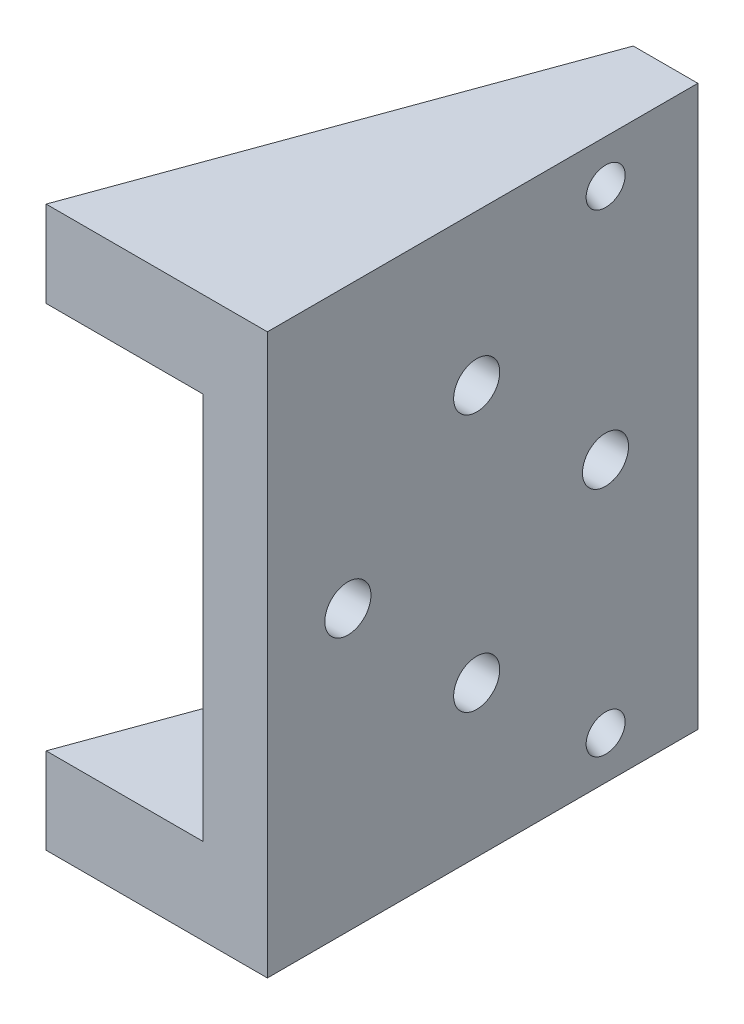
ISO-10303-21;
HEADER;
FILE_DESCRIPTION(('STEP AP214'),'2;1');
FILE_NAME('part.step','',(''),(''),'','','');
FILE_SCHEMA(('AUTOMOTIVE_DESIGN { 1 0 10303 214 1 1 1 1 }'));
ENDSEC;
DATA;
#1=APPLICATION_CONTEXT('core data for automotive mechanical design processes');
#2=APPLICATION_PROTOCOL_DEFINITION('international standard','automotive_design',2000,#1);
#3=PRODUCT_CONTEXT('',#1,'mechanical');
#4=PRODUCT('Part','Part','',(#3));
#5=PRODUCT_RELATED_PRODUCT_CATEGORY('part','',(#4));
#6=PRODUCT_DEFINITION_FORMATION('','',#4);
#7=PRODUCT_DEFINITION_CONTEXT('part definition',#1,'design');
#8=PRODUCT_DEFINITION('design','',#6,#7);
#9=PRODUCT_DEFINITION_SHAPE('','',#8);
#10=(LENGTH_UNIT() NAMED_UNIT(*) SI_UNIT(.MILLI.,.METRE.));
#11=(NAMED_UNIT(*) PLANE_ANGLE_UNIT() SI_UNIT($,.RADIAN.));
#12=(NAMED_UNIT(*) SI_UNIT($,.STERADIAN.) SOLID_ANGLE_UNIT());
#13=UNCERTAINTY_MEASURE_WITH_UNIT(LENGTH_MEASURE(1.E-05),#10,'distance_accuracy_value','');
#14=(GEOMETRIC_REPRESENTATION_CONTEXT(3) GLOBAL_UNCERTAINTY_ASSIGNED_CONTEXT((#13)) GLOBAL_UNIT_ASSIGNED_CONTEXT((#10,
#11,#12)) REPRESENTATION_CONTEXT('',''));
#15=CARTESIAN_POINT('',(0.,0.,0.));
#16=DIRECTION('',(0.,0.,1.));
#17=DIRECTION('',(1.,0.,0.));
#18=AXIS2_PLACEMENT_3D('',#15,#16,#17);
#19=CARTESIAN_POINT('',(0.,20.6375,0.));
#20=DIRECTION('',(0.939692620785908,0.,0.342020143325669));
#21=DIRECTION('',(0.342020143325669,0.,-0.939692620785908));
#22=AXIS2_PLACEMENT_3D('',#19,#20,#21);
#23=PLANE('',#22);
#24=CARTESIAN_POINT('',(-1.6288709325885,17.4625,4.47528610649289));
#25=DIRECTION('',(-0.939692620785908,0.,-0.342020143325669));
#26=DIRECTION('',(-0.342020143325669,0.,0.939692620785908));
#27=AXIS2_PLACEMENT_3D('',#24,#25,#26);
#28=CIRCLE('',#27,1.35254999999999);
#29=CARTESIAN_POINT('',(-2.09147027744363,17.4625,5.74626736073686));
#30=VERTEX_POINT('',#29);
#31=EDGE_CURVE('E404',#30,#30,#28,.T.);
#32=ORIENTED_EDGE('',*,*,#31,.F.);
#33=EDGE_LOOP('',(#32));
#34=FACE_BOUND('',#33,.T.);
#35=CARTESIAN_POINT('',(-9.2302686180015,17.4625,25.3599546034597));
#36=DIRECTION('',(-0.939692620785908,0.,-0.342020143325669));
#37=DIRECTION('',(-0.342020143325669,0.,0.939692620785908));
#38=AXIS2_PLACEMENT_3D('',#35,#36,#37);
#39=CIRCLE('',#38,1.35254999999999);
#40=CARTESIAN_POINT('',(-9.69286796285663,17.4625,26.6309358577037));
#41=VERTEX_POINT('',#40);
#42=EDGE_CURVE('E125',#41,#41,#39,.T.);
#43=ORIENTED_EDGE('',*,*,#42,.F.);
#44=EDGE_LOOP('',(#43));
#45=FACE_BOUND('',#44,.T.);
#46=DIRECTION('',(0.342020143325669,0.,-0.939692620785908));
#47=VECTOR('',#46,1.);
#48=CARTESIAN_POINT('',(-11.556054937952,14.2875,31.75));
#49=LINE('',#48,#47);
#50=CARTESIAN_POINT('',(-11.556054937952,14.2875,31.75));
#51=VERTEX_POINT('',#50);
#52=CARTESIAN_POINT('',(0.,14.2875,0.));
#53=VERTEX_POINT('',#52);
#54=EDGE_CURVE('E150',#51,#53,#49,.T.);
#55=ORIENTED_EDGE('',*,*,#54,.F.);
#56=DIRECTION('',(0.,-1.,0.));
#57=VECTOR('',#56,1.);
#58=CARTESIAN_POINT('',(-11.556054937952,20.6375,31.75));
#59=LINE('',#58,#57);
#60=CARTESIAN_POINT('',(-11.556054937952,20.6375,31.75));
#61=VERTEX_POINT('',#60);
#62=EDGE_CURVE('E200',#61,#51,#59,.T.);
#63=ORIENTED_EDGE('',*,*,#62,.F.);
#64=DIRECTION('',(-0.342020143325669,0.,0.939692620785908));
#65=VECTOR('',#64,1.);
#66=CARTESIAN_POINT('',(0.,20.6375,0.));
#67=LINE('',#66,#65);
#68=CARTESIAN_POINT('',(0.,20.6375,0.));
#69=VERTEX_POINT('',#68);
#70=EDGE_CURVE('E92',#69,#61,#67,.T.);
#71=ORIENTED_EDGE('',*,*,#70,.F.);
#72=DIRECTION('',(0.,-1.,0.));
#73=VECTOR('',#72,1.);
#74=CARTESIAN_POINT('',(0.,20.6375,0.));
#75=LINE('',#74,#73);
#76=EDGE_CURVE('E12',#69,#53,#75,.T.);
#77=ORIENTED_EDGE('',*,*,#76,.T.);
#78=EDGE_LOOP('',(#55,#63,#71,#77));
#79=FACE_BOUND('',#78,.T.);
#80=ADVANCED_FACE('F38',(#34,#45,#79),#23,.F.);
#81=CARTESIAN_POINT('',(4.7625,20.6375,31.75));
#82=DIRECTION('',(0.,0.,-1.));
#83=DIRECTION('',(-1.,0.,0.));
#84=AXIS2_PLACEMENT_3D('',#81,#82,#83);
#85=PLANE('',#84);
#86=DIRECTION('',(-1.,0.,0.));
#87=VECTOR('',#86,1.);
#88=CARTESIAN_POINT('',(-11.556054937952,14.2875,31.75));
#89=LINE('',#88,#87);
#90=CARTESIAN_POINT('',(0.,14.2875,31.75));
#91=VERTEX_POINT('',#90);
#92=EDGE_CURVE('E149',#91,#51,#89,.T.);
#93=ORIENTED_EDGE('',*,*,#92,.F.);
#94=DIRECTION('',(0.,-1.,0.));
#95=VECTOR('',#94,1.);
#96=CARTESIAN_POINT('',(0.,54.4251442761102,31.75));
#97=LINE('',#96,#95);
#98=CARTESIAN_POINT('',(0.,-14.2875,31.75));
#99=VERTEX_POINT('',#98);
#100=EDGE_CURVE('E154',#91,#99,#97,.T.);
#101=ORIENTED_EDGE('',*,*,#100,.T.);
#102=DIRECTION('',(1.,0.,0.));
#103=VECTOR('',#102,1.);
#104=CARTESIAN_POINT('',(-11.556054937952,-14.2875,31.75));
#105=LINE('',#104,#103);
#106=CARTESIAN_POINT('',(-11.556054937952,-14.2875,31.75));
#107=VERTEX_POINT('',#106);
#108=EDGE_CURVE('E142',#107,#99,#105,.T.);
#109=ORIENTED_EDGE('',*,*,#108,.F.);
#110=CARTESIAN_POINT('',(-11.556054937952,-20.6375,31.75));
#111=VERTEX_POINT('',#110);
#112=EDGE_CURVE('E199',#107,#111,#59,.T.);
#113=ORIENTED_EDGE('',*,*,#112,.T.);
#114=DIRECTION('',(1.,0.,0.));
#115=VECTOR('',#114,1.);
#116=CARTESIAN_POINT('',(4.7625,-20.6375,31.75));
#117=LINE('',#116,#115);
#118=CARTESIAN_POINT('',(4.7625,-20.6375,31.75));
#119=VERTEX_POINT('',#118);
#120=EDGE_CURVE('E193',#111,#119,#117,.T.);
#121=ORIENTED_EDGE('',*,*,#120,.T.);
#122=DIRECTION('',(0.,-1.,0.));
#123=VECTOR('',#122,1.);
#124=CARTESIAN_POINT('',(4.7625,20.6375,31.75));
#125=LINE('',#124,#123);
#126=CARTESIAN_POINT('',(4.7625,20.6375,31.75));
#127=VERTEX_POINT('',#126);
#128=EDGE_CURVE('E197',#127,#119,#125,.T.);
#129=ORIENTED_EDGE('',*,*,#128,.F.);
#130=DIRECTION('',(1.,0.,0.));
#131=VECTOR('',#130,1.);
#132=CARTESIAN_POINT('',(4.7625,20.6375,31.75));
#133=LINE('',#132,#131);
#134=EDGE_CURVE('E184',#61,#127,#133,.T.);
#135=ORIENTED_EDGE('',*,*,#134,.F.);
#136=ORIENTED_EDGE('',*,*,#62,.T.);
#137=EDGE_LOOP('',(#93,#101,#109,#113,#121,#129,#135,#136));
#138=FACE_BOUND('',#137,.T.);
#139=ADVANCED_FACE('F224',(#138),#85,.F.);
#140=CARTESIAN_POINT('',(4.7625,0.,25.8125));
#141=DIRECTION('',(1.,0.,0.));
#142=DIRECTION('',(0.,0.,-1.));
#143=AXIS2_PLACEMENT_3D('',#140,#141,#142);
#144=CYLINDRICAL_SURFACE('',#143,1.69999999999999);
#145=CARTESIAN_POINT('',(4.7625,0.,25.8125));
#146=DIRECTION('',(1.,0.,0.));
#147=DIRECTION('',(0.,0.,-1.));
#148=AXIS2_PLACEMENT_3D('',#145,#146,#147);
#149=CIRCLE('',#148,1.69999999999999);
#150=CARTESIAN_POINT('',(4.7625,0.,24.1125));
#151=VERTEX_POINT('',#150);
#152=EDGE_CURVE('E177',#151,#151,#149,.T.);
#153=ORIENTED_EDGE('',*,*,#152,.T.);
#154=EDGE_LOOP('',(#153));
#155=FACE_BOUND('',#154,.T.);
#156=CARTESIAN_POINT('',(0.,0.,25.8125));
#157=DIRECTION('',(-1.,0.,0.));
#158=DIRECTION('',(0.,0.,1.));
#159=AXIS2_PLACEMENT_3D('',#156,#157,#158);
#160=CIRCLE('',#159,1.69999999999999);
#161=CARTESIAN_POINT('',(0.,0.,27.5125));
#162=VERTEX_POINT('',#161);
#163=EDGE_CURVE('E165',#162,#162,#160,.F.);
#164=ORIENTED_EDGE('',*,*,#163,.F.);
#165=EDGE_LOOP('',(#164));
#166=FACE_BOUND('',#165,.T.);
#167=ADVANCED_FACE('F229',(#155,#166),#144,.F.);
#168=CARTESIAN_POINT('',(4.7625,-9.50000000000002,16.3125));
#169=DIRECTION('',(1.,0.,0.));
#170=DIRECTION('',(0.,0.,-1.));
#171=AXIS2_PLACEMENT_3D('',#168,#169,#170);
#172=CYLINDRICAL_SURFACE('',#171,1.69999999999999);
#173=CARTESIAN_POINT('',(4.7625,-9.50000000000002,16.3125));
#174=DIRECTION('',(1.,0.,0.));
#175=DIRECTION('',(0.,0.,-1.));
#176=AXIS2_PLACEMENT_3D('',#173,#174,#175);
#177=CIRCLE('',#176,1.69999999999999);
#178=CARTESIAN_POINT('',(4.7625,-9.50000000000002,14.6125));
#179=VERTEX_POINT('',#178);
#180=EDGE_CURVE('E174',#179,#179,#177,.T.);
#181=ORIENTED_EDGE('',*,*,#180,.T.);
#182=EDGE_LOOP('',(#181));
#183=FACE_BOUND('',#182,.T.);
#184=CARTESIAN_POINT('',(0.,-9.50000000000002,16.3125));
#185=DIRECTION('',(-1.,0.,0.));
#186=DIRECTION('',(0.,0.,1.));
#187=AXIS2_PLACEMENT_3D('',#184,#185,#186);
#188=CIRCLE('',#187,1.69999999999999);
#189=CARTESIAN_POINT('',(0.,-9.50000000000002,18.0125));
#190=VERTEX_POINT('',#189);
#191=EDGE_CURVE('E162',#190,#190,#188,.F.);
#192=ORIENTED_EDGE('',*,*,#191,.F.);
#193=EDGE_LOOP('',(#192));
#194=FACE_BOUND('',#193,.T.);
#195=ADVANCED_FACE('F219',(#183,#194),#172,.F.);
#196=CARTESIAN_POINT('',(4.7625,0.,6.81249999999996));
#197=DIRECTION('',(1.,0.,0.));
#198=DIRECTION('',(0.,0.,-1.));
#199=AXIS2_PLACEMENT_3D('',#196,#197,#198);
#200=CYLINDRICAL_SURFACE('',#199,1.69999999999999);
#201=CARTESIAN_POINT('',(4.7625,0.,6.81249999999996));
#202=DIRECTION('',(1.,0.,0.));
#203=DIRECTION('',(0.,0.,-1.));
#204=AXIS2_PLACEMENT_3D('',#201,#202,#203);
#205=CIRCLE('',#204,1.69999999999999);
#206=CARTESIAN_POINT('',(4.7625,0.,5.11249999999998));
#207=VERTEX_POINT('',#206);
#208=EDGE_CURVE('E171',#207,#207,#205,.T.);
#209=ORIENTED_EDGE('',*,*,#208,.T.);
#210=EDGE_LOOP('',(#209));
#211=FACE_BOUND('',#210,.T.);
#212=CARTESIAN_POINT('',(0.,0.,6.81249999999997));
#213=DIRECTION('',(-1.,0.,0.));
#214=DIRECTION('',(0.,0.,1.));
#215=AXIS2_PLACEMENT_3D('',#212,#213,#214);
#216=CIRCLE('',#215,1.69999999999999);
#217=CARTESIAN_POINT('',(0.,0.,8.51249999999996));
#218=VERTEX_POINT('',#217);
#219=EDGE_CURVE('E159',#218,#218,#216,.F.);
#220=ORIENTED_EDGE('',*,*,#219,.F.);
#221=EDGE_LOOP('',(#220));
#222=FACE_BOUND('',#221,.T.);
#223=ADVANCED_FACE('F210',(#211,#222),#200,.F.);
#224=CARTESIAN_POINT('',(4.7625,9.50000000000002,16.3125));
#225=DIRECTION('',(1.,0.,0.));
#226=DIRECTION('',(0.,0.,-1.));
#227=AXIS2_PLACEMENT_3D('',#224,#225,#226);
#228=CYLINDRICAL_SURFACE('',#227,1.69999999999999);
#229=CARTESIAN_POINT('',(4.7625,9.50000000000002,16.3125));
#230=DIRECTION('',(1.,0.,0.));
#231=DIRECTION('',(0.,0.,-1.));
#232=AXIS2_PLACEMENT_3D('',#229,#230,#231);
#233=CIRCLE('',#232,1.69999999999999);
#234=CARTESIAN_POINT('',(4.7625,9.50000000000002,14.6125));
#235=VERTEX_POINT('',#234);
#236=EDGE_CURVE('E168',#235,#235,#233,.T.);
#237=ORIENTED_EDGE('',*,*,#236,.T.);
#238=EDGE_LOOP('',(#237));
#239=FACE_BOUND('',#238,.T.);
#240=CARTESIAN_POINT('',(0.,9.50000000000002,16.3125));
#241=DIRECTION('',(-1.,0.,0.));
#242=DIRECTION('',(0.,0.,1.));
#243=AXIS2_PLACEMENT_3D('',#240,#241,#242);
#244=CIRCLE('',#243,1.69999999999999);
#245=CARTESIAN_POINT('',(0.,9.50000000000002,18.0125));
#246=VERTEX_POINT('',#245);
#247=EDGE_CURVE('E152',#246,#246,#244,.F.);
#248=ORIENTED_EDGE('',*,*,#247,.F.);
#249=EDGE_LOOP('',(#248));
#250=FACE_BOUND('',#249,.T.);
#251=ADVANCED_FACE('F208',(#239,#250),#228,.F.);
#252=CARTESIAN_POINT('',(0.,20.6375,0.));
#253=DIRECTION('',(0.,0.,1.));
#254=DIRECTION('',(1.,0.,0.));
#255=AXIS2_PLACEMENT_3D('',#252,#253,#254);
#256=PLANE('',#255);
#257=DIRECTION('',(-1.,0.,0.));
#258=VECTOR('',#257,1.);
#259=CARTESIAN_POINT('',(0.,-20.6375,0.));
#260=LINE('',#259,#258);
#261=CARTESIAN_POINT('',(4.7625,-20.6375,0.));
#262=VERTEX_POINT('',#261);
#263=CARTESIAN_POINT('',(0.,-20.6375,0.));
#264=VERTEX_POINT('',#263);
#265=EDGE_CURVE('E180',#262,#264,#260,.T.);
#266=ORIENTED_EDGE('',*,*,#265,.T.);
#267=CARTESIAN_POINT('',(0.,-14.2875,0.));
#268=VERTEX_POINT('',#267);
#269=EDGE_CURVE('E47',#268,#264,#75,.T.);
#270=ORIENTED_EDGE('',*,*,#269,.F.);
#271=DIRECTION('',(0.,-1.,0.));
#272=VECTOR('',#271,1.);
#273=CARTESIAN_POINT('',(0.,54.4251442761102,0.));
#274=LINE('',#273,#272);
#275=EDGE_CURVE('E144',#53,#268,#274,.T.);
#276=ORIENTED_EDGE('',*,*,#275,.F.);
#277=ORIENTED_EDGE('',*,*,#76,.F.);
#278=DIRECTION('',(-1.,0.,0.));
#279=VECTOR('',#278,1.);
#280=CARTESIAN_POINT('',(0.,20.6375,0.));
#281=LINE('',#280,#279);
#282=CARTESIAN_POINT('',(4.7625,20.6375,0.));
#283=VERTEX_POINT('',#282);
#284=EDGE_CURVE('E181',#283,#69,#281,.T.);
#285=ORIENTED_EDGE('',*,*,#284,.F.);
#286=DIRECTION('',(0.,-1.,0.));
#287=VECTOR('',#286,1.);
#288=CARTESIAN_POINT('',(4.7625,20.6375,0.));
#289=LINE('',#288,#287);
#290=EDGE_CURVE('E187',#283,#262,#289,.T.);
#291=ORIENTED_EDGE('',*,*,#290,.T.);
#292=EDGE_LOOP('',(#266,#270,#276,#277,#285,#291));
#293=FACE_BOUND('',#292,.T.);
#294=ADVANCED_FACE('F40',(#293),#256,.F.);
#295=CARTESIAN_POINT('',(-9.2302686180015,-17.4625,25.3599546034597));
#296=DIRECTION('',(-0.939692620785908,0.,-0.342020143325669));
#297=DIRECTION('',(-0.342020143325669,0.,0.939692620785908));
#298=AXIS2_PLACEMENT_3D('',#295,#296,#297);
#299=CIRCLE('',#298,1.35254999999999);
#300=CARTESIAN_POINT('',(-9.69286796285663,-17.4625,26.6309358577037));
#301=VERTEX_POINT('',#300);
#302=EDGE_CURVE('E124',#301,#301,#299,.T.);
#303=ORIENTED_EDGE('',*,*,#302,.F.);
#304=EDGE_LOOP('',(#303));
#305=FACE_BOUND('',#304,.T.);
#306=CARTESIAN_POINT('',(-1.6288709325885,-17.4625,4.47528610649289));
#307=DIRECTION('',(-0.939692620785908,0.,-0.342020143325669));
#308=DIRECTION('',(-0.342020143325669,0.,0.939692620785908));
#309=AXIS2_PLACEMENT_3D('',#306,#307,#308);
#310=CIRCLE('',#309,1.35254999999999);
#311=CARTESIAN_POINT('',(-2.09147027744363,-17.4625,5.74626736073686));
#312=VERTEX_POINT('',#311);
#313=EDGE_CURVE('E137',#312,#312,#310,.T.);
#314=ORIENTED_EDGE('',*,*,#313,.F.);
#315=EDGE_LOOP('',(#314));
#316=FACE_BOUND('',#315,.T.);
#317=ORIENTED_EDGE('',*,*,#112,.F.);
#318=DIRECTION('',(-0.342020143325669,0.,0.939692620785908));
#319=VECTOR('',#318,1.);
#320=CARTESIAN_POINT('',(-11.556054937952,-14.2875,31.75));
#321=LINE('',#320,#319);
#322=EDGE_CURVE('E55',#268,#107,#321,.T.);
#323=ORIENTED_EDGE('',*,*,#322,.F.);
#324=ORIENTED_EDGE('',*,*,#269,.T.);
#325=DIRECTION('',(-0.342020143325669,0.,0.939692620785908));
#326=VECTOR('',#325,1.);
#327=CARTESIAN_POINT('',(0.,-20.6375,0.));
#328=LINE('',#327,#326);
#329=EDGE_CURVE('E190',#264,#111,#328,.T.);
#330=ORIENTED_EDGE('',*,*,#329,.T.);
#331=EDGE_LOOP('',(#317,#323,#324,#330));
#332=FACE_BOUND('',#331,.T.);
#333=ADVANCED_FACE('F217',(#305,#316,#332),#23,.F.);
#334=CARTESIAN_POINT('',(4.7625,20.6375,0.));
#335=DIRECTION('',(-1.,0.,0.));
#336=DIRECTION('',(0.,0.,1.));
#337=AXIS2_PLACEMENT_3D('',#334,#335,#336);
#338=PLANE('',#337);
#339=CARTESIAN_POINT('',(4.7625,17.4625,6.80155488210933));
#340=DIRECTION('',(-1.,0.,0.));
#341=DIRECTION('',(0.,0.,-1.));
#342=AXIS2_PLACEMENT_3D('',#339,#340,#341);
#343=ELLIPSE('',#342,1.43935364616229,1.35254999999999);
#344=CARTESIAN_POINT('',(4.7625,17.4625,5.36220123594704));
#345=VERTEX_POINT('',#344);
#346=EDGE_CURVE('E131',#345,#345,#343,.T.);
#347=ORIENTED_EDGE('',*,*,#346,.T.);
#348=EDGE_LOOP('',(#347));
#349=FACE_BOUND('',#348,.T.);
#350=CARTESIAN_POINT('',(4.7625,-17.4625,6.80155488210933));
#351=DIRECTION('',(-1.,0.,0.));
#352=DIRECTION('',(0.,0.,-1.));
#353=AXIS2_PLACEMENT_3D('',#350,#351,#352);
#354=ELLIPSE('',#353,1.43935364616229,1.35254999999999);
#355=CARTESIAN_POINT('',(4.7625,-17.4625,5.36220123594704));
#356=VERTEX_POINT('',#355);
#357=EDGE_CURVE('E42',#356,#356,#354,.T.);
#358=ORIENTED_EDGE('',*,*,#357,.T.);
#359=EDGE_LOOP('',(#358));
#360=FACE_BOUND('',#359,.T.);
#361=ORIENTED_EDGE('',*,*,#236,.F.);
#362=EDGE_LOOP('',(#361));
#363=FACE_BOUND('',#362,.T.);
#364=ORIENTED_EDGE('',*,*,#208,.F.);
#365=EDGE_LOOP('',(#364));
#366=FACE_BOUND('',#365,.T.);
#367=ORIENTED_EDGE('',*,*,#180,.F.);
#368=EDGE_LOOP('',(#367));
#369=FACE_BOUND('',#368,.T.);
#370=ORIENTED_EDGE('',*,*,#152,.F.);
#371=EDGE_LOOP('',(#370));
#372=FACE_BOUND('',#371,.T.);
#373=DIRECTION('',(0.,0.,-1.));
#374=VECTOR('',#373,1.);
#375=CARTESIAN_POINT('',(4.7625,-20.6375,0.));
#376=LINE('',#375,#374);
#377=EDGE_CURVE('E85',#119,#262,#376,.T.);
#378=ORIENTED_EDGE('',*,*,#377,.T.);
#379=ORIENTED_EDGE('',*,*,#290,.F.);
#380=DIRECTION('',(0.,0.,-1.));
#381=VECTOR('',#380,1.);
#382=CARTESIAN_POINT('',(4.7625,20.6375,0.));
#383=LINE('',#382,#381);
#384=EDGE_CURVE('E64',#127,#283,#383,.T.);
#385=ORIENTED_EDGE('',*,*,#384,.F.);
#386=ORIENTED_EDGE('',*,*,#128,.T.);
#387=EDGE_LOOP('',(#378,#379,#385,#386));
#388=FACE_BOUND('',#387,.T.);
#389=ADVANCED_FACE('F235',(#349,#360,#363,#366,#369,#372,#388),#338,.F.);
#390=CARTESIAN_POINT('',(0.,20.6375,0.));
#391=DIRECTION('',(0.,-1.,0.));
#392=DIRECTION('',(0.,0.,-1.));
#393=AXIS2_PLACEMENT_3D('',#390,#391,#392);
#394=PLANE('',#393);
#395=ORIENTED_EDGE('',*,*,#284,.T.);
#396=ORIENTED_EDGE('',*,*,#70,.T.);
#397=ORIENTED_EDGE('',*,*,#134,.T.);
#398=ORIENTED_EDGE('',*,*,#384,.T.);
#399=EDGE_LOOP('',(#395,#396,#397,#398));
#400=FACE_BOUND('',#399,.T.);
#401=ADVANCED_FACE('F240',(#400),#394,.F.);
#402=CARTESIAN_POINT('',(0.,-20.6375,0.));
#403=DIRECTION('',(0.,-1.,0.));
#404=DIRECTION('',(0.,0.,-1.));
#405=AXIS2_PLACEMENT_3D('',#402,#403,#404);
#406=PLANE('',#405);
#407=ORIENTED_EDGE('',*,*,#265,.F.);
#408=ORIENTED_EDGE('',*,*,#377,.F.);
#409=ORIENTED_EDGE('',*,*,#120,.F.);
#410=ORIENTED_EDGE('',*,*,#329,.F.);
#411=EDGE_LOOP('',(#407,#408,#409,#410));
#412=FACE_BOUND('',#411,.T.);
#413=ADVANCED_FACE('F263',(#412),#406,.T.);
#414=CARTESIAN_POINT('',(0.,54.4251442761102,31.75));
#415=DIRECTION('',(-1.,0.,0.));
#416=DIRECTION('',(0.,0.,1.));
#417=AXIS2_PLACEMENT_3D('',#414,#415,#416);
#418=PLANE('',#417);
#419=ORIENTED_EDGE('',*,*,#275,.T.);
#420=DIRECTION('',(0.,0.,-1.));
#421=VECTOR('',#420,1.);
#422=CARTESIAN_POINT('',(0.,-14.2875,31.75));
#423=LINE('',#422,#421);
#424=EDGE_CURVE('E140',#99,#268,#423,.T.);
#425=ORIENTED_EDGE('',*,*,#424,.F.);
#426=ORIENTED_EDGE('',*,*,#100,.F.);
#427=DIRECTION('',(0.,0.,1.));
#428=VECTOR('',#427,1.);
#429=CARTESIAN_POINT('',(0.,14.2875,31.75));
#430=LINE('',#429,#428);
#431=EDGE_CURVE('E146',#53,#91,#430,.T.);
#432=ORIENTED_EDGE('',*,*,#431,.F.);
#433=EDGE_LOOP('',(#419,#425,#426,#432));
#434=FACE_BOUND('',#433,.T.);
#435=ORIENTED_EDGE('',*,*,#247,.T.);
#436=EDGE_LOOP('',(#435));
#437=FACE_BOUND('',#436,.T.);
#438=ORIENTED_EDGE('',*,*,#219,.T.);
#439=EDGE_LOOP('',(#438));
#440=FACE_BOUND('',#439,.T.);
#441=ORIENTED_EDGE('',*,*,#191,.T.);
#442=EDGE_LOOP('',(#441));
#443=FACE_BOUND('',#442,.T.);
#444=ORIENTED_EDGE('',*,*,#163,.T.);
#445=EDGE_LOOP('',(#444));
#446=FACE_BOUND('',#445,.T.);
#447=ADVANCED_FACE('F205',(#434,#437,#440,#443,#446),#418,.T.);
#448=CARTESIAN_POINT('',(0.,14.2875,0.));
#449=DIRECTION('',(0.,-1.,0.));
#450=DIRECTION('',(0.,0.,-1.));
#451=AXIS2_PLACEMENT_3D('',#448,#449,#450);
#452=PLANE('',#451);
#453=ORIENTED_EDGE('',*,*,#431,.T.);
#454=ORIENTED_EDGE('',*,*,#92,.T.);
#455=ORIENTED_EDGE('',*,*,#54,.T.);
#456=EDGE_LOOP('',(#453,#454,#455));
#457=FACE_BOUND('',#456,.T.);
#458=ADVANCED_FACE('F270',(#457),#452,.T.);
#459=CARTESIAN_POINT('',(0.,-14.2875,0.));
#460=DIRECTION('',(0.,-1.,0.));
#461=DIRECTION('',(0.,0.,-1.));
#462=AXIS2_PLACEMENT_3D('',#459,#460,#461);
#463=PLANE('',#462);
#464=ORIENTED_EDGE('',*,*,#108,.T.);
#465=ORIENTED_EDGE('',*,*,#424,.T.);
#466=ORIENTED_EDGE('',*,*,#322,.T.);
#467=EDGE_LOOP('',(#464,#465,#466));
#468=FACE_BOUND('',#467,.T.);
#469=ADVANCED_FACE('F253',(#468),#463,.F.);
#470=CARTESIAN_POINT('',(-1.6288709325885,-17.4625,4.47528610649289));
#471=DIRECTION('',(-0.939692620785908,0.,-0.342020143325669));
#472=DIRECTION('',(-0.342020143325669,0.,0.939692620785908));
#473=AXIS2_PLACEMENT_3D('',#470,#471,#472);
#474=CYLINDRICAL_SURFACE('',#473,1.35254999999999);
#475=ORIENTED_EDGE('',*,*,#313,.T.);
#476=EDGE_LOOP('',(#475));
#477=FACE_BOUND('',#476,.T.);
#478=ORIENTED_EDGE('',*,*,#357,.F.);
#479=EDGE_LOOP('',(#478));
#480=FACE_BOUND('',#479,.T.);
#481=ADVANCED_FACE('F331',(#477,#480),#474,.F.);
#482=CARTESIAN_POINT('',(-1.35376507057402,-17.4625,28.2267674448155));
#483=DIRECTION('',(-0.939692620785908,0.,-0.342020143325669));
#484=DIRECTION('',(-0.342020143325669,0.,0.939692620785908));
#485=AXIS2_PLACEMENT_3D('',#482,#483,#484);
#486=CONICAL_SURFACE('',#485,1.35255,1.02974425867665);
#487=CARTESIAN_POINT('',(-0.590082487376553,-17.4625,28.5047251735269));
#488=VERTEX_POINT('',#487);
#489=VERTEX_LOOP('',#488);
#490=FACE_BOUND('',#489,.T.);
#491=CARTESIAN_POINT('',(-1.35376507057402,-17.4625,28.2267674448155));
#492=DIRECTION('',(-0.939692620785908,0.,-0.342020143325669));
#493=DIRECTION('',(-0.342020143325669,0.,0.939692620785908));
#494=AXIS2_PLACEMENT_3D('',#491,#492,#493);
#495=CIRCLE('',#494,1.35255);
#496=CARTESIAN_POINT('',(-1.81636441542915,-17.4625,29.4977486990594));
#497=VERTEX_POINT('',#496);
#498=EDGE_CURVE('E128',#497,#497,#495,.T.);
#499=ORIENTED_EDGE('',*,*,#498,.T.);
#500=EDGE_LOOP('',(#499));
#501=FACE_BOUND('',#500,.T.);
#502=ADVANCED_FACE('F355',(#490,#501),#486,.F.);
#503=CARTESIAN_POINT('',(-9.2302686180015,-17.4625,25.3599546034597));
#504=DIRECTION('',(-0.939692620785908,0.,-0.342020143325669));
#505=DIRECTION('',(-0.342020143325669,0.,0.939692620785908));
#506=AXIS2_PLACEMENT_3D('',#503,#504,#505);
#507=CYLINDRICAL_SURFACE('',#506,1.35254999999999);
#508=ORIENTED_EDGE('',*,*,#498,.F.);
#509=EDGE_LOOP('',(#508));
#510=FACE_BOUND('',#509,.T.);
#511=ORIENTED_EDGE('',*,*,#302,.T.);
#512=EDGE_LOOP('',(#511));
#513=FACE_BOUND('',#512,.T.);
#514=ADVANCED_FACE('F118',(#510,#513),#507,.F.);
#515=CARTESIAN_POINT('',(-1.35376507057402,17.4625,28.2267674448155));
#516=DIRECTION('',(-0.939692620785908,0.,-0.342020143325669));
#517=DIRECTION('',(-0.342020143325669,0.,0.939692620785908));
#518=AXIS2_PLACEMENT_3D('',#515,#516,#517);
#519=CONICAL_SURFACE('',#518,1.35255,1.02974425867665);
#520=CARTESIAN_POINT('',(-0.590082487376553,17.4625,28.5047251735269));
#521=VERTEX_POINT('',#520);
#522=VERTEX_LOOP('',#521);
#523=FACE_BOUND('',#522,.T.);
#524=CARTESIAN_POINT('',(-1.35376507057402,17.4625,28.2267674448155));
#525=DIRECTION('',(-0.939692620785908,0.,-0.342020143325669));
#526=DIRECTION('',(-0.342020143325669,0.,0.939692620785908));
#527=AXIS2_PLACEMENT_3D('',#524,#525,#526);
#528=CIRCLE('',#527,1.35255);
#529=CARTESIAN_POINT('',(-1.81636441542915,17.4625,29.4977486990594));
#530=VERTEX_POINT('',#529);
#531=EDGE_CURVE('E122',#530,#530,#528,.T.);
#532=ORIENTED_EDGE('',*,*,#531,.T.);
#533=EDGE_LOOP('',(#532));
#534=FACE_BOUND('',#533,.T.);
#535=ADVANCED_FACE('F114',(#523,#534),#519,.F.);
#536=CARTESIAN_POINT('',(-9.2302686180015,17.4625,25.3599546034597));
#537=DIRECTION('',(-0.939692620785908,0.,-0.342020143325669));
#538=DIRECTION('',(-0.342020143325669,0.,0.939692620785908));
#539=AXIS2_PLACEMENT_3D('',#536,#537,#538);
#540=CYLINDRICAL_SURFACE('',#539,1.35254999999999);
#541=ORIENTED_EDGE('',*,*,#531,.F.);
#542=EDGE_LOOP('',(#541));
#543=FACE_BOUND('',#542,.T.);
#544=ORIENTED_EDGE('',*,*,#42,.T.);
#545=EDGE_LOOP('',(#544));
#546=FACE_BOUND('',#545,.T.);
#547=ADVANCED_FACE('F117',(#543,#546),#540,.F.);
#548=CARTESIAN_POINT('',(-1.6288709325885,17.4625,4.47528610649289));
#549=DIRECTION('',(-0.939692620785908,0.,-0.342020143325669));
#550=DIRECTION('',(-0.342020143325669,0.,0.939692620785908));
#551=AXIS2_PLACEMENT_3D('',#548,#549,#550);
#552=CYLINDRICAL_SURFACE('',#551,1.35254999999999);
#553=ORIENTED_EDGE('',*,*,#31,.T.);
#554=EDGE_LOOP('',(#553));
#555=FACE_BOUND('',#554,.T.);
#556=ORIENTED_EDGE('',*,*,#346,.F.);
#557=EDGE_LOOP('',(#556));
#558=FACE_BOUND('',#557,.T.);
#559=ADVANCED_FACE('F389',(#555,#558),#552,.F.);
#560=CLOSED_SHELL('',(#80,#139,#167,#195,#223,#251,#294,#333,#389,#401,#413,#447,#458,#469,#481,
#502,#514,#535,#547,#559));
#561=MANIFOLD_SOLID_BREP('B2',#560);
#562=ADVANCED_BREP_SHAPE_REPRESENTATION('',(#18,#561),#14);
#563=SHAPE_DEFINITION_REPRESENTATION(#9,#562);
ENDSEC;
END-ISO-10303-21;
